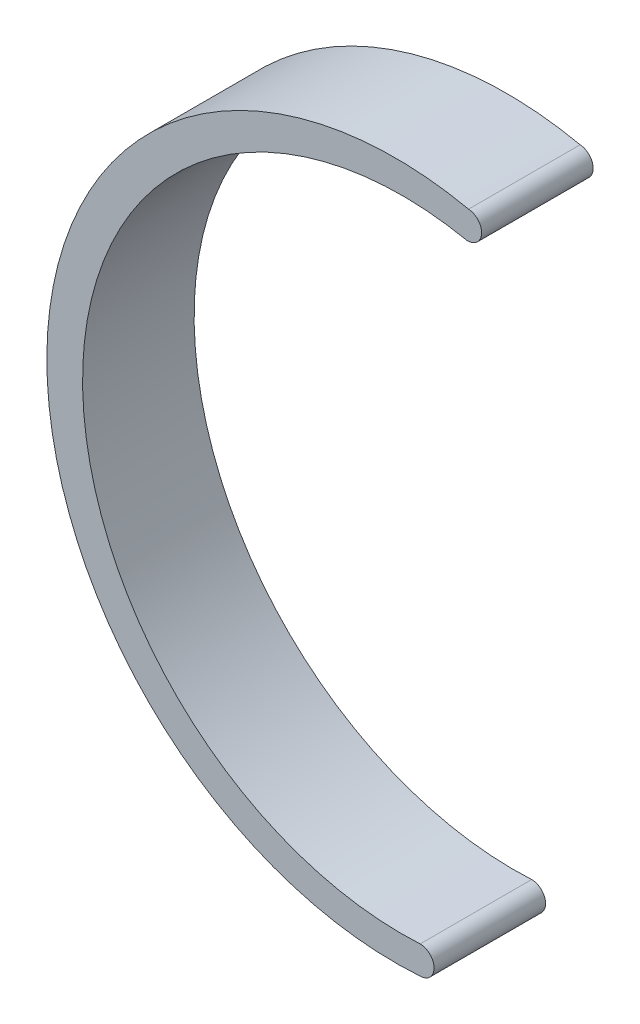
from build123d import *

# Parameters (mm, degrees)
BOSS_EXTRUDE1_DEPTH = 30.48


with BuildPart() as part:
    # Sketch1 → Boss-Extrude1 (new body)
    with BuildSketch(Plane.XY):
        with BuildLine():
            ThreePointArc((10.422262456, 93.124203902), (-104.603390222, 6.69344033), (-2.831130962, -95.009976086))
            ThreePointArc((-2.831130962, -95.009976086), (0.978869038, -91.199976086), (-2.831130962, -87.389976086))
            ThreePointArc((-2.831130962, -87.389976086), (-94.841089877, 6.292226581), (9.88546017, 85.504203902))
            ThreePointArc((9.88546017, 85.504203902), (13.963861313, 89.045802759), (10.422262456, 93.124203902))
        make_face()
    extrude(amount=BOSS_EXTRUDE1_DEPTH)


solid = part.part
